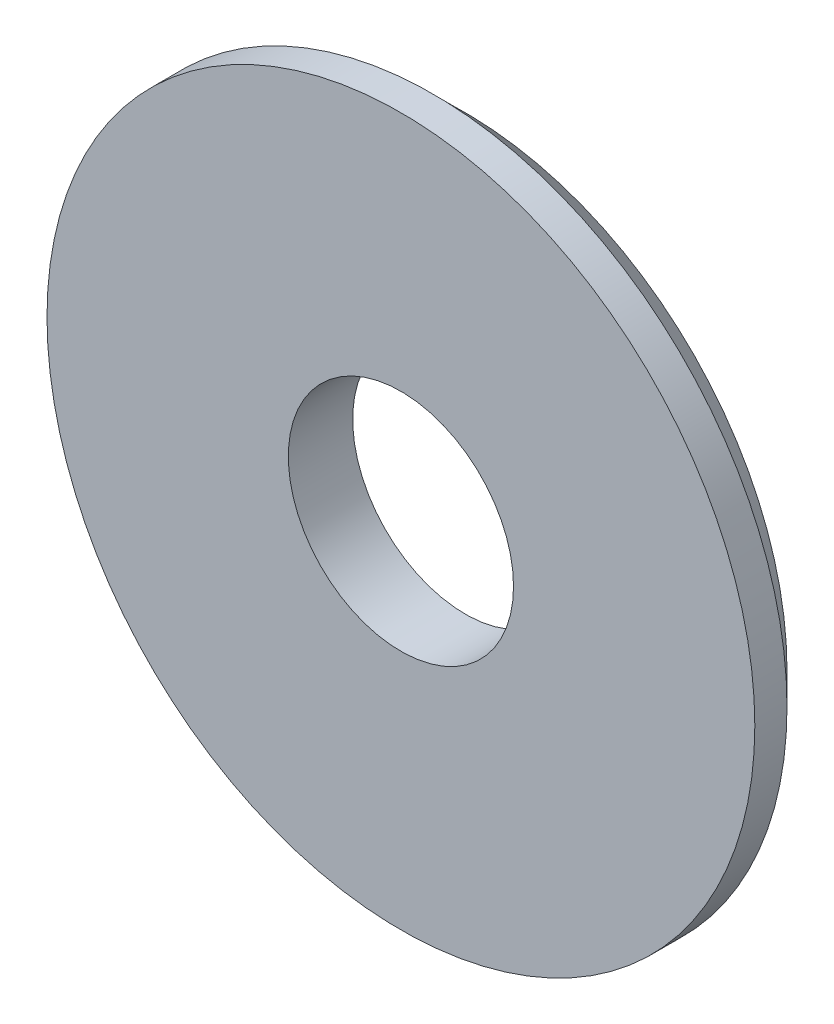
from build123d import *

# Parameters (mm, degrees)
ESQUISSE1_R          = 11
ESQUISSE1_R_2        = 3.5
BASE_EXTRUSION_DEPTH = 2
CHANFREIN1_SIZE      = 1


with BuildPart() as part:
    # Esquisse1 → Base-Extrusion (new body)
    with BuildSketch(Plane.XY):
        Circle(ESQUISSE1_R)
        Circle(ESQUISSE1_R_2, mode=Mode.SUBTRACT)
    extrude(amount=BASE_EXTRUSION_DEPTH)

    # Chanfrein1
    chanfrein1_edges = [part.edges().sort_by_distance(p)[0] for p in [
        (-11, 0, 0),
    ]]
    chamfer(chanfrein1_edges, length=CHANFREIN1_SIZE)


solid = part.part
